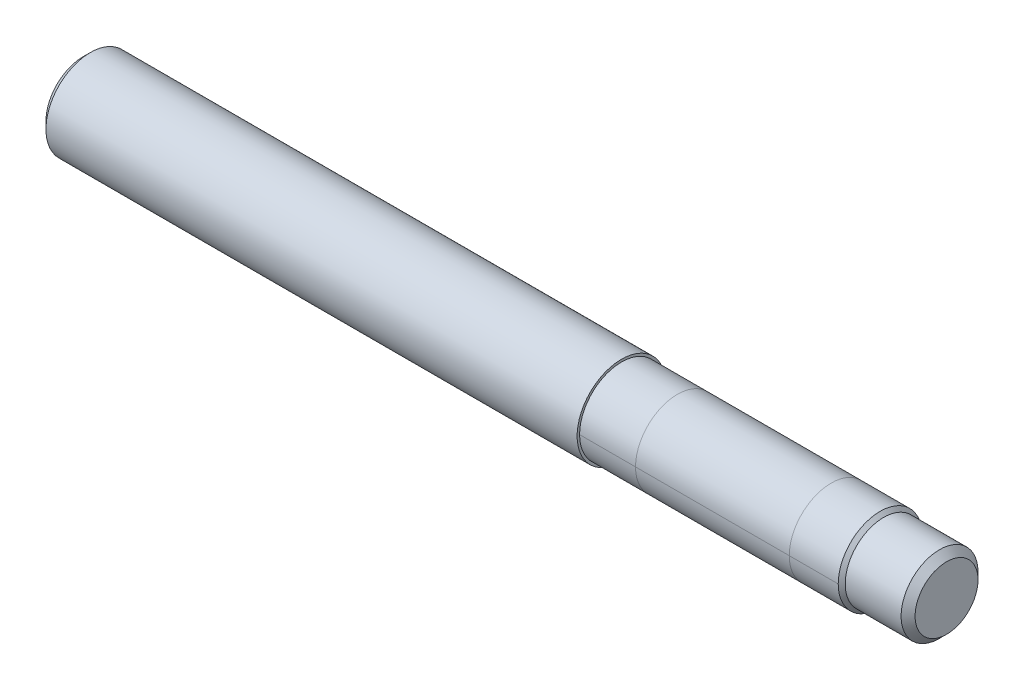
ISO-10303-21;
HEADER;
FILE_DESCRIPTION(('STEP AP214'),'2;1');
FILE_NAME('part.step','',(''),(''),'','','');
FILE_SCHEMA(('AUTOMOTIVE_DESIGN { 1 0 10303 214 1 1 1 1 }'));
ENDSEC;
DATA;
#1=APPLICATION_CONTEXT('core data for automotive mechanical design processes');
#2=APPLICATION_PROTOCOL_DEFINITION('international standard','automotive_design',2000,#1);
#3=PRODUCT_CONTEXT('',#1,'mechanical');
#4=PRODUCT('Part','Part','',(#3));
#5=PRODUCT_RELATED_PRODUCT_CATEGORY('part','',(#4));
#6=PRODUCT_DEFINITION_FORMATION('','',#4);
#7=PRODUCT_DEFINITION_CONTEXT('part definition',#1,'design');
#8=PRODUCT_DEFINITION('design','',#6,#7);
#9=PRODUCT_DEFINITION_SHAPE('','',#8);
#10=(LENGTH_UNIT() NAMED_UNIT(*) SI_UNIT(.MILLI.,.METRE.));
#11=(NAMED_UNIT(*) PLANE_ANGLE_UNIT() SI_UNIT($,.RADIAN.));
#12=(NAMED_UNIT(*) SI_UNIT($,.STERADIAN.) SOLID_ANGLE_UNIT());
#13=UNCERTAINTY_MEASURE_WITH_UNIT(LENGTH_MEASURE(1.E-05),#10,'distance_accuracy_value','');
#14=(GEOMETRIC_REPRESENTATION_CONTEXT(3) GLOBAL_UNCERTAINTY_ASSIGNED_CONTEXT((#13)) GLOBAL_UNIT_ASSIGNED_CONTEXT((#10,
#11,#12)) REPRESENTATION_CONTEXT('',''));
#15=CARTESIAN_POINT('',(0.,0.,0.));
#16=DIRECTION('',(0.,0.,1.));
#17=DIRECTION('',(1.,0.,0.));
#18=AXIS2_PLACEMENT_3D('',#15,#16,#17);
#19=CARTESIAN_POINT('',(77.,0.,0.));
#20=DIRECTION('',(1.,0.,0.));
#21=DIRECTION('',(0.,0.,-1.));
#22=AXIS2_PLACEMENT_3D('',#19,#20,#21);
#23=CYLINDRICAL_SURFACE('',#22,6.);
#24=CARTESIAN_POINT('',(106.9974,0.,0.));
#25=DIRECTION('',(1.,0.,0.));
#26=DIRECTION('',(0.,0.,-1.));
#27=AXIS2_PLACEMENT_3D('',#24,#25,#26);
#28=CIRCLE('',#27,6.);
#29=CARTESIAN_POINT('',(106.9974,0.,-6.));
#30=VERTEX_POINT('',#29);
#31=CARTESIAN_POINT('',(106.9974,-6.,0.));
#32=VERTEX_POINT('',#31);
#33=EDGE_CURVE('E45',#30,#32,#28,.F.);
#34=ORIENTED_EDGE('',*,*,#33,.T.);
#35=CARTESIAN_POINT('',(106.9974,0.,6.));
#36=VERTEX_POINT('',#35);
#37=EDGE_CURVE('E12',#32,#36,#28,.F.);
#38=ORIENTED_EDGE('',*,*,#37,.T.);
#39=DIRECTION('',(1.,0.,0.));
#40=VECTOR('',#39,1.);
#41=CARTESIAN_POINT('',(77.,0.,6.));
#42=LINE('',#41,#40);
#43=CARTESIAN_POINT('',(85.001,0.,6.));
#44=VERTEX_POINT('',#43);
#45=EDGE_CURVE('E98',#36,#44,#42,.F.);
#46=ORIENTED_EDGE('',*,*,#45,.T.);
#47=CARTESIAN_POINT('',(85.001,0.,0.));
#48=DIRECTION('',(1.,0.,0.));
#49=DIRECTION('',(0.,0.,-1.));
#50=AXIS2_PLACEMENT_3D('',#47,#48,#49);
#51=CIRCLE('',#50,6.);
#52=CARTESIAN_POINT('',(85.001,-6.,0.));
#53=VERTEX_POINT('',#52);
#54=EDGE_CURVE('E133',#53,#44,#51,.F.);
#55=ORIENTED_EDGE('',*,*,#54,.F.);
#56=CARTESIAN_POINT('',(85.001,0.,-6.));
#57=VERTEX_POINT('',#56);
#58=EDGE_CURVE('E137',#57,#53,#51,.F.);
#59=ORIENTED_EDGE('',*,*,#58,.F.);
#60=DIRECTION('',(1.,0.,0.));
#61=VECTOR('',#60,1.);
#62=CARTESIAN_POINT('',(77.,0.,-6.));
#63=LINE('',#62,#61);
#64=EDGE_CURVE('E131',#57,#30,#63,.T.);
#65=ORIENTED_EDGE('',*,*,#64,.T.);
#66=EDGE_LOOP('',(#34,#38,#46,#55,#59,#65));
#67=FACE_BOUND('',#66,.T.);
#68=ADVANCED_FACE('F35',(#67),#23,.T.);
#69=ORIENTED_EDGE('',*,*,#45,.F.);
#70=CARTESIAN_POINT('',(106.9974,0.,0.));
#71=DIRECTION('',(1.,0.,0.));
#72=DIRECTION('',(0.,0.,-1.));
#73=AXIS2_PLACEMENT_3D('',#70,#71,#72);
#74=CIRCLE('',#73,6.);
#75=CARTESIAN_POINT('',(106.9974,6.,0.));
#76=VERTEX_POINT('',#75);
#77=EDGE_CURVE('E58',#36,#76,#74,.F.);
#78=ORIENTED_EDGE('',*,*,#77,.T.);
#79=EDGE_CURVE('E39',#76,#30,#74,.F.);
#80=ORIENTED_EDGE('',*,*,#79,.T.);
#81=ORIENTED_EDGE('',*,*,#64,.F.);
#82=CARTESIAN_POINT('',(85.001,0.,0.));
#83=DIRECTION('',(1.,0.,0.));
#84=DIRECTION('',(0.,0.,-1.));
#85=AXIS2_PLACEMENT_3D('',#82,#83,#84);
#86=CIRCLE('',#85,6.);
#87=CARTESIAN_POINT('',(85.001,6.,0.));
#88=VERTEX_POINT('',#87);
#89=EDGE_CURVE('E97',#88,#57,#86,.F.);
#90=ORIENTED_EDGE('',*,*,#89,.F.);
#91=EDGE_CURVE('E140',#44,#88,#86,.F.);
#92=ORIENTED_EDGE('',*,*,#91,.F.);
#93=EDGE_LOOP('',(#69,#78,#80,#81,#90,#92));
#94=FACE_BOUND('',#93,.T.);
#95=ADVANCED_FACE('F193',(#94),#23,.T.);
#96=ORIENTED_EDGE('',*,*,#58,.T.);
#97=ORIENTED_EDGE('',*,*,#54,.T.);
#98=CARTESIAN_POINT('',(77.,0.,6.));
#99=VERTEX_POINT('',#98);
#100=EDGE_CURVE('E100',#44,#99,#42,.F.);
#101=ORIENTED_EDGE('',*,*,#100,.T.);
#102=CARTESIAN_POINT('',(77.,0.,0.));
#103=DIRECTION('',(1.,0.,0.));
#104=DIRECTION('',(0.,0.,-1.));
#105=AXIS2_PLACEMENT_3D('',#102,#103,#104);
#106=CIRCLE('',#105,6.);
#107=CARTESIAN_POINT('',(77.,0.,-6.));
#108=VERTEX_POINT('',#107);
#109=EDGE_CURVE('E109',#99,#108,#106,.T.);
#110=ORIENTED_EDGE('',*,*,#109,.T.);
#111=EDGE_CURVE('E128',#108,#57,#63,.T.);
#112=ORIENTED_EDGE('',*,*,#111,.T.);
#113=EDGE_LOOP('',(#96,#97,#101,#110,#112));
#114=FACE_BOUND('',#113,.T.);
#115=ADVANCED_FACE('F157',(#114),#23,.T.);
#116=ORIENTED_EDGE('',*,*,#100,.F.);
#117=ORIENTED_EDGE('',*,*,#91,.T.);
#118=ORIENTED_EDGE('',*,*,#89,.T.);
#119=ORIENTED_EDGE('',*,*,#111,.F.);
#120=EDGE_CURVE('E111',#108,#99,#106,.T.);
#121=ORIENTED_EDGE('',*,*,#120,.T.);
#122=EDGE_LOOP('',(#116,#117,#118,#119,#121));
#123=FACE_BOUND('',#122,.T.);
#124=ADVANCED_FACE('F173',(#123),#23,.T.);
#125=ORIENTED_EDGE('',*,*,#37,.F.);
#126=ORIENTED_EDGE('',*,*,#33,.F.);
#127=CARTESIAN_POINT('',(114.,0.,-6.));
#128=VERTEX_POINT('',#127);
#129=EDGE_CURVE('E108',#30,#128,#63,.T.);
#130=ORIENTED_EDGE('',*,*,#129,.T.);
#131=CARTESIAN_POINT('',(114.,0.,0.));
#132=DIRECTION('',(-1.,0.,0.));
#133=DIRECTION('',(0.,0.,1.));
#134=AXIS2_PLACEMENT_3D('',#131,#132,#133);
#135=CIRCLE('',#134,6.);
#136=CARTESIAN_POINT('',(114.,0.,6.));
#137=VERTEX_POINT('',#136);
#138=EDGE_CURVE('E104',#137,#128,#135,.F.);
#139=ORIENTED_EDGE('',*,*,#138,.F.);
#140=EDGE_CURVE('E89',#137,#36,#42,.F.);
#141=ORIENTED_EDGE('',*,*,#140,.T.);
#142=EDGE_LOOP('',(#125,#126,#130,#139,#141));
#143=FACE_BOUND('',#142,.T.);
#144=ADVANCED_FACE('F107',(#143),#23,.T.);
#145=CARTESIAN_POINT('',(123.5,0.,0.));
#146=DIRECTION('',(-1.,0.,0.));
#147=DIRECTION('',(0.,0.,1.));
#148=AXIS2_PLACEMENT_3D('',#145,#146,#147);
#149=CYLINDRICAL_SURFACE('',#148,6.35);
#150=CARTESIAN_POINT('',(1.00000000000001,0.,0.));
#151=DIRECTION('',(1.,0.,0.));
#152=DIRECTION('',(0.,0.,-1.));
#153=AXIS2_PLACEMENT_3D('',#150,#151,#152);
#154=CIRCLE('',#153,6.35);
#155=CARTESIAN_POINT('',(1.00000000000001,0.,-6.35));
#156=VERTEX_POINT('',#155);
#157=EDGE_CURVE('E116',#156,#156,#154,.T.);
#158=ORIENTED_EDGE('',*,*,#157,.T.);
#159=EDGE_LOOP('',(#158));
#160=FACE_BOUND('',#159,.T.);
#161=CARTESIAN_POINT('',(77.,0.,0.));
#162=DIRECTION('',(1.,0.,0.));
#163=DIRECTION('',(0.,0.,-1.));
#164=AXIS2_PLACEMENT_3D('',#161,#162,#163);
#165=CIRCLE('',#164,6.35);
#166=CARTESIAN_POINT('',(77.,0.,-6.35));
#167=VERTEX_POINT('',#166);
#168=EDGE_CURVE('E115',#167,#167,#165,.T.);
#169=ORIENTED_EDGE('',*,*,#168,.F.);
#170=EDGE_LOOP('',(#169));
#171=FACE_BOUND('',#170,.T.);
#172=ADVANCED_FACE('F205',(#160,#171),#149,.T.);
#173=CARTESIAN_POINT('',(0.,0.,0.));
#174=DIRECTION('',(1.,0.,0.));
#175=DIRECTION('',(0.,0.,-1.));
#176=AXIS2_PLACEMENT_3D('',#173,#174,#175);
#177=PLANE('',#176);
#178=CARTESIAN_POINT('',(0.,0.,0.));
#179=DIRECTION('',(1.,0.,0.));
#180=DIRECTION('',(0.,0.,-1.));
#181=AXIS2_PLACEMENT_3D('',#178,#179,#180);
#182=CIRCLE('',#181,5.34999999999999);
#183=CARTESIAN_POINT('',(0.,0.,-5.34999999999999));
#184=VERTEX_POINT('',#183);
#185=EDGE_CURVE('E119',#184,#184,#182,.F.);
#186=ORIENTED_EDGE('',*,*,#185,.T.);
#187=EDGE_LOOP('',(#186));
#188=FACE_BOUND('',#187,.T.);
#189=ADVANCED_FACE('F203',(#188),#177,.F.);
#190=CARTESIAN_POINT('',(77.,0.,0.));
#191=DIRECTION('',(1.,0.,0.));
#192=DIRECTION('',(0.,0.,-1.));
#193=AXIS2_PLACEMENT_3D('',#190,#191,#192);
#194=PLANE('',#193);
#195=ORIENTED_EDGE('',*,*,#120,.F.);
#196=ORIENTED_EDGE('',*,*,#109,.F.);
#197=EDGE_LOOP('',(#195,#196));
#198=FACE_BOUND('',#197,.T.);
#199=ORIENTED_EDGE('',*,*,#168,.T.);
#200=EDGE_LOOP('',(#199));
#201=FACE_BOUND('',#200,.T.);
#202=ADVANCED_FACE('F171',(#198,#201),#194,.T.);
#203=ORIENTED_EDGE('',*,*,#77,.F.);
#204=ORIENTED_EDGE('',*,*,#140,.F.);
#205=EDGE_CURVE('E93',#128,#137,#135,.F.);
#206=ORIENTED_EDGE('',*,*,#205,.F.);
#207=ORIENTED_EDGE('',*,*,#129,.F.);
#208=ORIENTED_EDGE('',*,*,#79,.F.);
#209=EDGE_LOOP('',(#203,#204,#206,#207,#208));
#210=FACE_BOUND('',#209,.T.);
#211=ADVANCED_FACE('F91',(#210),#23,.T.);
#212=CARTESIAN_POINT('',(127.965017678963,0.,0.));
#213=DIRECTION('',(1.,0.,0.));
#214=DIRECTION('',(0.,0.,-1.));
#215=AXIS2_PLACEMENT_3D('',#212,#213,#214);
#216=CYLINDRICAL_SURFACE('',#215,5.5);
#217=CARTESIAN_POINT('',(122.5,0.,0.));
#218=DIRECTION('',(1.,0.,0.));
#219=DIRECTION('',(0.,0.,-1.));
#220=AXIS2_PLACEMENT_3D('',#217,#218,#219);
#221=CIRCLE('',#220,5.5);
#222=CARTESIAN_POINT('',(122.5,0.,-5.5));
#223=VERTEX_POINT('',#222);
#224=EDGE_CURVE('E125',#223,#223,#221,.F.);
#225=ORIENTED_EDGE('',*,*,#224,.T.);
#226=EDGE_LOOP('',(#225));
#227=FACE_BOUND('',#226,.T.);
#228=CARTESIAN_POINT('',(114.5,0.,0.));
#229=DIRECTION('',(1.,0.,0.));
#230=DIRECTION('',(0.,0.,-1.));
#231=AXIS2_PLACEMENT_3D('',#228,#229,#230);
#232=CIRCLE('',#231,5.5);
#233=CARTESIAN_POINT('',(114.5,0.,-5.5));
#234=VERTEX_POINT('',#233);
#235=EDGE_CURVE('E105',#234,#234,#232,.T.);
#236=ORIENTED_EDGE('',*,*,#235,.T.);
#237=EDGE_LOOP('',(#236));
#238=FACE_BOUND('',#237,.T.);
#239=ADVANCED_FACE('F179',(#227,#238),#216,.T.);
#240=CARTESIAN_POINT('',(112.600148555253,0.,0.));
#241=DIRECTION('',(-1.,0.,0.));
#242=DIRECTION('',(0.,0.,1.));
#243=AXIS2_PLACEMENT_3D('',#240,#241,#242);
#244=CONICAL_SURFACE('',#243,7.39985144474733,0.785398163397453);
#245=ORIENTED_EDGE('',*,*,#138,.T.);
#246=ORIENTED_EDGE('',*,*,#205,.T.);
#247=EDGE_LOOP('',(#245,#246));
#248=FACE_BOUND('',#247,.T.);
#249=ORIENTED_EDGE('',*,*,#235,.F.);
#250=EDGE_LOOP('',(#249));
#251=FACE_BOUND('',#250,.T.);
#252=ADVANCED_FACE('F102',(#248,#251),#244,.T.);
#253=CARTESIAN_POINT('',(123.5,0.,0.));
#254=DIRECTION('',(1.,0.,0.));
#255=DIRECTION('',(0.,0.,-1.));
#256=AXIS2_PLACEMENT_3D('',#253,#254,#255);
#257=PLANE('',#256);
#258=CARTESIAN_POINT('',(123.5,0.,0.));
#259=DIRECTION('',(1.,0.,0.));
#260=DIRECTION('',(0.,0.,-1.));
#261=AXIS2_PLACEMENT_3D('',#258,#259,#260);
#262=CIRCLE('',#261,4.5);
#263=CARTESIAN_POINT('',(123.5,0.,-4.5));
#264=VERTEX_POINT('',#263);
#265=EDGE_CURVE('E122',#264,#264,#262,.T.);
#266=ORIENTED_EDGE('',*,*,#265,.T.);
#267=EDGE_LOOP('',(#266));
#268=FACE_BOUND('',#267,.T.);
#269=ADVANCED_FACE('F181',(#268),#257,.T.);
#270=CARTESIAN_POINT('',(1.00000000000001,0.,0.));
#271=DIRECTION('',(1.,0.,0.));
#272=DIRECTION('',(0.,0.,-1.));
#273=AXIS2_PLACEMENT_3D('',#270,#271,#272);
#274=CONICAL_SURFACE('',#273,6.35,0.785398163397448);
#275=ORIENTED_EDGE('',*,*,#185,.F.);
#276=EDGE_LOOP('',(#275));
#277=FACE_BOUND('',#276,.T.);
#278=ORIENTED_EDGE('',*,*,#157,.F.);
#279=EDGE_LOOP('',(#278));
#280=FACE_BOUND('',#279,.T.);
#281=ADVANCED_FACE('F187',(#277,#280),#274,.T.);
#282=CARTESIAN_POINT('',(123.5,0.,0.));
#283=DIRECTION('',(-1.,0.,0.));
#284=DIRECTION('',(0.,0.,1.));
#285=AXIS2_PLACEMENT_3D('',#282,#283,#284);
#286=CONICAL_SURFACE('',#285,4.5,0.785398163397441);
#287=ORIENTED_EDGE('',*,*,#224,.F.);
#288=EDGE_LOOP('',(#287));
#289=FACE_BOUND('',#288,.T.);
#290=ORIENTED_EDGE('',*,*,#265,.F.);
#291=EDGE_LOOP('',(#290));
#292=FACE_BOUND('',#291,.T.);
#293=ADVANCED_FACE('F37',(#289,#292),#286,.T.);
#294=CLOSED_SHELL('',(#68,#95,#115,#124,#144,#172,#189,#202,#211,#239,#252,#269,#281,#293));
#295=MANIFOLD_SOLID_BREP('B2',#294);
#296=ADVANCED_BREP_SHAPE_REPRESENTATION('',(#18,#295),#14);
#297=SHAPE_DEFINITION_REPRESENTATION(#9,#296);
ENDSEC;
END-ISO-10303-21;
